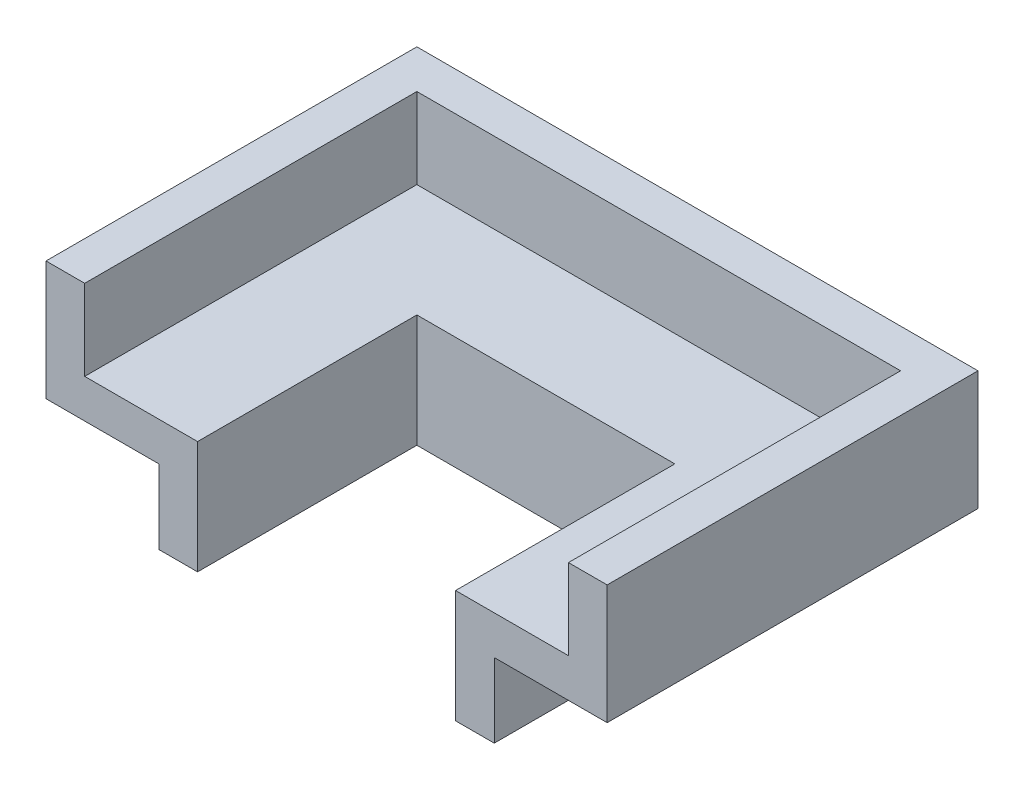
ISO-10303-21;
HEADER;
FILE_DESCRIPTION(('STEP AP214'),'2;1');
FILE_NAME('part.step','',(''),(''),'','','');
FILE_SCHEMA(('AUTOMOTIVE_DESIGN { 1 0 10303 214 1 1 1 1 }'));
ENDSEC;
DATA;
#1=APPLICATION_CONTEXT('core data for automotive mechanical design processes');
#2=APPLICATION_PROTOCOL_DEFINITION('international standard','automotive_design',2000,#1);
#3=PRODUCT_CONTEXT('',#1,'mechanical');
#4=PRODUCT('Part','Part','',(#3));
#5=PRODUCT_RELATED_PRODUCT_CATEGORY('part','',(#4));
#6=PRODUCT_DEFINITION_FORMATION('','',#4);
#7=PRODUCT_DEFINITION_CONTEXT('part definition',#1,'design');
#8=PRODUCT_DEFINITION('design','',#6,#7);
#9=PRODUCT_DEFINITION_SHAPE('','',#8);
#10=(LENGTH_UNIT() NAMED_UNIT(*) SI_UNIT(.MILLI.,.METRE.));
#11=(NAMED_UNIT(*) PLANE_ANGLE_UNIT() SI_UNIT($,.RADIAN.));
#12=(NAMED_UNIT(*) SI_UNIT($,.STERADIAN.) SOLID_ANGLE_UNIT());
#13=UNCERTAINTY_MEASURE_WITH_UNIT(LENGTH_MEASURE(1.E-05),#10,'distance_accuracy_value','');
#14=(GEOMETRIC_REPRESENTATION_CONTEXT(3) GLOBAL_UNCERTAINTY_ASSIGNED_CONTEXT((#13)) GLOBAL_UNIT_ASSIGNED_CONTEXT((#10,
#11,#12)) REPRESENTATION_CONTEXT('',''));
#15=CARTESIAN_POINT('',(0.,0.,0.));
#16=DIRECTION('',(0.,0.,1.));
#17=DIRECTION('',(1.,0.,0.));
#18=AXIS2_PLACEMENT_3D('',#15,#16,#17);
#19=CARTESIAN_POINT('',(-40.,0.,-68.));
#20=DIRECTION('',(1.,0.,0.));
#21=DIRECTION('',(0.,0.,-1.));
#22=AXIS2_PLACEMENT_3D('',#19,#20,#21);
#23=PLANE('',#22);
#24=DIRECTION('',(0.,0.,1.));
#25=VECTOR('',#24,1.);
#26=CARTESIAN_POINT('',(-40.,35.,-68.));
#27=LINE('',#26,#25);
#28=CARTESIAN_POINT('',(-40.,35.,-68.));
#29=VERTEX_POINT('',#28);
#30=CARTESIAN_POINT('',(-40.,35.,0.));
#31=VERTEX_POINT('',#30);
#32=EDGE_CURVE('E237',#29,#31,#27,.T.);
#33=ORIENTED_EDGE('',*,*,#32,.T.);
#34=DIRECTION('',(0.,-1.,0.));
#35=VECTOR('',#34,1.);
#36=CARTESIAN_POINT('',(-40.,0.,0.));
#37=LINE('',#36,#35);
#38=CARTESIAN_POINT('',(-39.9999999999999,0.,0.));
#39=VERTEX_POINT('',#38);
#40=EDGE_CURVE('E265',#31,#39,#37,.T.);
#41=ORIENTED_EDGE('',*,*,#40,.T.);
#42=DIRECTION('',(0.,0.,1.));
#43=VECTOR('',#42,1.);
#44=CARTESIAN_POINT('',(-40.,0.,-68.));
#45=LINE('',#44,#43);
#46=CARTESIAN_POINT('',(-40.,0.,-68.));
#47=VERTEX_POINT('',#46);
#48=EDGE_CURVE('E238',#47,#39,#45,.T.);
#49=ORIENTED_EDGE('',*,*,#48,.F.);
#50=DIRECTION('',(0.,1.,0.));
#51=VECTOR('',#50,1.);
#52=CARTESIAN_POINT('',(-40.,0.,-68.));
#53=LINE('',#52,#51);
#54=EDGE_CURVE('E240',#47,#29,#53,.T.);
#55=ORIENTED_EDGE('',*,*,#54,.T.);
#56=EDGE_LOOP('',(#33,#41,#49,#55));
#57=FACE_BOUND('',#56,.T.);
#58=ADVANCED_FACE('F41',(#57),#23,.T.);
#59=CARTESIAN_POINT('',(-52.,0.,-80.));
#60=DIRECTION('',(-1.,0.,0.));
#61=DIRECTION('',(0.,0.,1.));
#62=AXIS2_PLACEMENT_3D('',#59,#60,#61);
#63=PLANE('',#62);
#64=DIRECTION('',(0.,0.,1.));
#65=VECTOR('',#64,1.);
#66=CARTESIAN_POINT('',(-52.,0.,-80.));
#67=LINE('',#66,#65);
#68=CARTESIAN_POINT('',(-52.,0.,-80.));
#69=VERTEX_POINT('',#68);
#70=CARTESIAN_POINT('',(-52.,0.,0.));
#71=VERTEX_POINT('',#70);
#72=EDGE_CURVE('E245',#69,#71,#67,.T.);
#73=ORIENTED_EDGE('',*,*,#72,.T.);
#74=DIRECTION('',(0.,1.,0.));
#75=VECTOR('',#74,1.);
#76=CARTESIAN_POINT('',(-52.,0.,0.));
#77=LINE('',#76,#75);
#78=CARTESIAN_POINT('',(-52.,23.,0.));
#79=VERTEX_POINT('',#78);
#80=EDGE_CURVE('E299',#71,#79,#77,.T.);
#81=ORIENTED_EDGE('',*,*,#80,.T.);
#82=DIRECTION('',(0.,0.,1.));
#83=VECTOR('',#82,1.);
#84=CARTESIAN_POINT('',(-52.,23.,-80.));
#85=LINE('',#84,#83);
#86=CARTESIAN_POINT('',(-52.,23.,-80.));
#87=VERTEX_POINT('',#86);
#88=EDGE_CURVE('E249',#87,#79,#85,.T.);
#89=ORIENTED_EDGE('',*,*,#88,.F.);
#90=DIRECTION('',(0.,-1.,0.));
#91=VECTOR('',#90,1.);
#92=CARTESIAN_POINT('',(-52.,0.,-80.));
#93=LINE('',#92,#91);
#94=EDGE_CURVE('E271',#87,#69,#93,.T.);
#95=ORIENTED_EDGE('',*,*,#94,.T.);
#96=EDGE_LOOP('',(#73,#81,#89,#95));
#97=FACE_BOUND('',#96,.T.);
#98=ADVANCED_FACE('F309',(#97),#63,.T.);
#99=CARTESIAN_POINT('',(-87.,23.,-115.));
#100=DIRECTION('',(-1.,0.,0.));
#101=DIRECTION('',(0.,0.,1.));
#102=AXIS2_PLACEMENT_3D('',#99,#100,#101);
#103=PLANE('',#102);
#104=DIRECTION('',(0.,0.,1.));
#105=VECTOR('',#104,1.);
#106=CARTESIAN_POINT('',(-87.,23.,-115.));
#107=LINE('',#106,#105);
#108=CARTESIAN_POINT('',(-87.,23.,-115.));
#109=VERTEX_POINT('',#108);
#110=CARTESIAN_POINT('',(-87.,23.,0.));
#111=VERTEX_POINT('',#110);
#112=EDGE_CURVE('E248',#109,#111,#107,.T.);
#113=ORIENTED_EDGE('',*,*,#112,.T.);
#114=DIRECTION('',(0.,1.,0.));
#115=VECTOR('',#114,1.);
#116=CARTESIAN_POINT('',(-87.,23.,0.));
#117=LINE('',#116,#115);
#118=CARTESIAN_POINT('',(-87.0000000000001,60.,0.));
#119=VERTEX_POINT('',#118);
#120=EDGE_CURVE('E49',#111,#119,#117,.T.);
#121=ORIENTED_EDGE('',*,*,#120,.T.);
#122=DIRECTION('',(0.,0.,1.));
#123=VECTOR('',#122,1.);
#124=CARTESIAN_POINT('',(-87.0000000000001,60.,-115.));
#125=LINE('',#124,#123);
#126=CARTESIAN_POINT('',(-87.0000000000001,60.,-115.));
#127=VERTEX_POINT('',#126);
#128=EDGE_CURVE('E252',#127,#119,#125,.T.);
#129=ORIENTED_EDGE('',*,*,#128,.F.);
#130=DIRECTION('',(0.,-1.,0.));
#131=VECTOR('',#130,1.);
#132=CARTESIAN_POINT('',(-87.,23.,-115.));
#133=LINE('',#132,#131);
#134=EDGE_CURVE('E235',#127,#109,#133,.T.);
#135=ORIENTED_EDGE('',*,*,#134,.T.);
#136=EDGE_LOOP('',(#113,#121,#129,#135));
#137=FACE_BOUND('',#136,.T.);
#138=ADVANCED_FACE('F303',(#137),#103,.T.);
#139=CARTESIAN_POINT('',(-75.,35.,-103.));
#140=DIRECTION('',(1.,0.,0.));
#141=DIRECTION('',(0.,0.,-1.));
#142=AXIS2_PLACEMENT_3D('',#139,#140,#141);
#143=PLANE('',#142);
#144=DIRECTION('',(0.,0.,1.));
#145=VECTOR('',#144,1.);
#146=CARTESIAN_POINT('',(-75.,60.,-103.));
#147=LINE('',#146,#145);
#148=CARTESIAN_POINT('',(-75.,60.,-103.));
#149=VERTEX_POINT('',#148);
#150=CARTESIAN_POINT('',(-75.,60.,0.));
#151=VERTEX_POINT('',#150);
#152=EDGE_CURVE('E255',#149,#151,#147,.T.);
#153=ORIENTED_EDGE('',*,*,#152,.T.);
#154=DIRECTION('',(0.,-1.,0.));
#155=VECTOR('',#154,1.);
#156=CARTESIAN_POINT('',(-75.,35.,0.));
#157=LINE('',#156,#155);
#158=CARTESIAN_POINT('',(-75.,35.,0.));
#159=VERTEX_POINT('',#158);
#160=EDGE_CURVE('E44',#151,#159,#157,.T.);
#161=ORIENTED_EDGE('',*,*,#160,.T.);
#162=DIRECTION('',(0.,0.,1.));
#163=VECTOR('',#162,1.);
#164=CARTESIAN_POINT('',(-75.,35.,-103.));
#165=LINE('',#164,#163);
#166=CARTESIAN_POINT('',(-75.,35.,-103.));
#167=VERTEX_POINT('',#166);
#168=EDGE_CURVE('E258',#167,#159,#165,.T.);
#169=ORIENTED_EDGE('',*,*,#168,.F.);
#170=DIRECTION('',(0.,1.,0.));
#171=VECTOR('',#170,1.);
#172=CARTESIAN_POINT('',(-75.,35.,-103.));
#173=LINE('',#172,#171);
#174=EDGE_CURVE('E231',#167,#149,#173,.T.);
#175=ORIENTED_EDGE('',*,*,#174,.T.);
#176=EDGE_LOOP('',(#153,#161,#169,#175));
#177=FACE_BOUND('',#176,.T.);
#178=ADVANCED_FACE('F43',(#177),#143,.T.);
#179=CARTESIAN_POINT('',(40.,0.,-68.));
#180=DIRECTION('',(0.,0.,-1.));
#181=DIRECTION('',(-1.,0.,0.));
#182=AXIS2_PLACEMENT_3D('',#179,#180,#181);
#183=PLANE('',#182);
#184=ORIENTED_EDGE('',*,*,#54,.F.);
#185=DIRECTION('',(-1.,0.,0.));
#186=VECTOR('',#185,1.);
#187=CARTESIAN_POINT('',(40.,0.,-68.));
#188=LINE('',#187,#186);
#189=CARTESIAN_POINT('',(40.,0.,-68.));
#190=VERTEX_POINT('',#189);
#191=EDGE_CURVE('E213',#190,#47,#188,.T.);
#192=ORIENTED_EDGE('',*,*,#191,.F.);
#193=DIRECTION('',(0.,-1.,0.));
#194=VECTOR('',#193,1.);
#195=CARTESIAN_POINT('',(40.,0.,-68.));
#196=LINE('',#195,#194);
#197=CARTESIAN_POINT('',(40.,35.,-68.));
#198=VERTEX_POINT('',#197);
#199=EDGE_CURVE('E177',#198,#190,#196,.T.);
#200=ORIENTED_EDGE('',*,*,#199,.F.);
#201=DIRECTION('',(-1.,0.,0.));
#202=VECTOR('',#201,1.);
#203=CARTESIAN_POINT('',(40.,35.,-68.));
#204=LINE('',#203,#202);
#205=EDGE_CURVE('E209',#198,#29,#204,.T.);
#206=ORIENTED_EDGE('',*,*,#205,.T.);
#207=EDGE_LOOP('',(#184,#192,#200,#206));
#208=FACE_BOUND('',#207,.T.);
#209=ADVANCED_FACE('F295',(#208),#183,.F.);
#210=CARTESIAN_POINT('',(52.,0.,-80.));
#211=DIRECTION('',(0.,0.,1.));
#212=DIRECTION('',(1.,0.,0.));
#213=AXIS2_PLACEMENT_3D('',#210,#211,#212);
#214=PLANE('',#213);
#215=ORIENTED_EDGE('',*,*,#94,.F.);
#216=DIRECTION('',(-1.,0.,0.));
#217=VECTOR('',#216,1.);
#218=CARTESIAN_POINT('',(52.,23.,-80.));
#219=LINE('',#218,#217);
#220=CARTESIAN_POINT('',(52.,23.,-80.));
#221=VERTEX_POINT('',#220);
#222=EDGE_CURVE('E220',#221,#87,#219,.T.);
#223=ORIENTED_EDGE('',*,*,#222,.F.);
#224=DIRECTION('',(0.,1.,0.));
#225=VECTOR('',#224,1.);
#226=CARTESIAN_POINT('',(52.,0.,-80.));
#227=LINE('',#226,#225);
#228=CARTESIAN_POINT('',(52.,0.,-80.));
#229=VERTEX_POINT('',#228);
#230=EDGE_CURVE('E196',#229,#221,#227,.T.);
#231=ORIENTED_EDGE('',*,*,#230,.F.);
#232=DIRECTION('',(-1.,0.,0.));
#233=VECTOR('',#232,1.);
#234=CARTESIAN_POINT('',(52.,0.,-80.));
#235=LINE('',#234,#233);
#236=EDGE_CURVE('E157',#229,#69,#235,.T.);
#237=ORIENTED_EDGE('',*,*,#236,.T.);
#238=EDGE_LOOP('',(#215,#223,#231,#237));
#239=FACE_BOUND('',#238,.T.);
#240=ADVANCED_FACE('F315',(#239),#214,.F.);
#241=CARTESIAN_POINT('',(87.,23.,-115.));
#242=DIRECTION('',(0.,0.,1.));
#243=DIRECTION('',(1.,0.,0.));
#244=AXIS2_PLACEMENT_3D('',#241,#242,#243);
#245=PLANE('',#244);
#246=ORIENTED_EDGE('',*,*,#134,.F.);
#247=DIRECTION('',(-1.,0.,0.));
#248=VECTOR('',#247,1.);
#249=CARTESIAN_POINT('',(87.,60.,-115.));
#250=LINE('',#249,#248);
#251=CARTESIAN_POINT('',(87.,60.,-115.));
#252=VERTEX_POINT('',#251);
#253=EDGE_CURVE('E224',#252,#127,#250,.T.);
#254=ORIENTED_EDGE('',*,*,#253,.F.);
#255=DIRECTION('',(0.,1.,0.));
#256=VECTOR('',#255,1.);
#257=CARTESIAN_POINT('',(87.,23.,-115.));
#258=LINE('',#257,#256);
#259=CARTESIAN_POINT('',(87.,23.,-115.));
#260=VERTEX_POINT('',#259);
#261=EDGE_CURVE('E280',#260,#252,#258,.T.);
#262=ORIENTED_EDGE('',*,*,#261,.F.);
#263=DIRECTION('',(-1.,0.,0.));
#264=VECTOR('',#263,1.);
#265=CARTESIAN_POINT('',(87.,23.,-115.));
#266=LINE('',#265,#264);
#267=EDGE_CURVE('E219',#260,#109,#266,.T.);
#268=ORIENTED_EDGE('',*,*,#267,.T.);
#269=EDGE_LOOP('',(#246,#254,#262,#268));
#270=FACE_BOUND('',#269,.T.);
#271=ADVANCED_FACE('F332',(#270),#245,.F.);
#272=CARTESIAN_POINT('',(75.,35.,-103.));
#273=DIRECTION('',(0.,0.,-1.));
#274=DIRECTION('',(-1.,0.,0.));
#275=AXIS2_PLACEMENT_3D('',#272,#273,#274);
#276=PLANE('',#275);
#277=ORIENTED_EDGE('',*,*,#174,.F.);
#278=DIRECTION('',(-1.,0.,0.));
#279=VECTOR('',#278,1.);
#280=CARTESIAN_POINT('',(75.,35.,-103.));
#281=LINE('',#280,#279);
#282=CARTESIAN_POINT('',(75.,35.,-103.));
#283=VERTEX_POINT('',#282);
#284=EDGE_CURVE('E228',#283,#167,#281,.T.);
#285=ORIENTED_EDGE('',*,*,#284,.F.);
#286=DIRECTION('',(0.,-1.,0.));
#287=VECTOR('',#286,1.);
#288=CARTESIAN_POINT('',(75.,35.,-103.));
#289=LINE('',#288,#287);
#290=CARTESIAN_POINT('',(75.,60.,-103.));
#291=VERTEX_POINT('',#290);
#292=EDGE_CURVE('E276',#291,#283,#289,.T.);
#293=ORIENTED_EDGE('',*,*,#292,.F.);
#294=DIRECTION('',(-1.,0.,0.));
#295=VECTOR('',#294,1.);
#296=CARTESIAN_POINT('',(75.,60.,-103.));
#297=LINE('',#296,#295);
#298=EDGE_CURVE('E226',#291,#149,#297,.T.);
#299=ORIENTED_EDGE('',*,*,#298,.T.);
#300=EDGE_LOOP('',(#277,#285,#293,#299));
#301=FACE_BOUND('',#300,.T.);
#302=ADVANCED_FACE('F328',(#301),#276,.F.);
#303=CARTESIAN_POINT('',(0.,0.,0.));
#304=DIRECTION('',(0.,0.,1.));
#305=DIRECTION('',(1.,0.,0.));
#306=AXIS2_PLACEMENT_3D('',#303,#304,#305);
#307=PLANE('',#306);
#308=DIRECTION('',(1.,0.,0.));
#309=VECTOR('',#308,1.);
#310=CARTESIAN_POINT('',(40.,0.,0.));
#311=LINE('',#310,#309);
#312=CARTESIAN_POINT('',(40.,0.,0.));
#313=VERTEX_POINT('',#312);
#314=CARTESIAN_POINT('',(52.,0.,0.));
#315=VERTEX_POINT('',#314);
#316=EDGE_CURVE('E156',#313,#315,#311,.T.);
#317=ORIENTED_EDGE('',*,*,#316,.T.);
#318=DIRECTION('',(0.,1.,0.));
#319=VECTOR('',#318,1.);
#320=CARTESIAN_POINT('',(52.,0.,0.));
#321=LINE('',#320,#319);
#322=CARTESIAN_POINT('',(52.,23.,0.));
#323=VERTEX_POINT('',#322);
#324=EDGE_CURVE('E170',#315,#323,#321,.T.);
#325=ORIENTED_EDGE('',*,*,#324,.T.);
#326=DIRECTION('',(1.,0.,0.));
#327=VECTOR('',#326,1.);
#328=CARTESIAN_POINT('',(52.,23.,0.));
#329=LINE('',#328,#327);
#330=CARTESIAN_POINT('',(87.,23.,0.));
#331=VERTEX_POINT('',#330);
#332=EDGE_CURVE('E172',#323,#331,#329,.T.);
#333=ORIENTED_EDGE('',*,*,#332,.T.);
#334=DIRECTION('',(0.,1.,0.));
#335=VECTOR('',#334,1.);
#336=CARTESIAN_POINT('',(87.,23.,0.));
#337=LINE('',#336,#335);
#338=CARTESIAN_POINT('',(87.,60.,0.));
#339=VERTEX_POINT('',#338);
#340=EDGE_CURVE('E184',#331,#339,#337,.T.);
#341=ORIENTED_EDGE('',*,*,#340,.T.);
#342=DIRECTION('',(-1.,0.,0.));
#343=VECTOR('',#342,1.);
#344=CARTESIAN_POINT('',(75.,60.,0.));
#345=LINE('',#344,#343);
#346=CARTESIAN_POINT('',(75.,60.,0.));
#347=VERTEX_POINT('',#346);
#348=EDGE_CURVE('E186',#339,#347,#345,.T.);
#349=ORIENTED_EDGE('',*,*,#348,.T.);
#350=DIRECTION('',(0.,-1.,0.));
#351=VECTOR('',#350,1.);
#352=CARTESIAN_POINT('',(75.,35.,0.));
#353=LINE('',#352,#351);
#354=CARTESIAN_POINT('',(75.,35.,0.));
#355=VERTEX_POINT('',#354);
#356=EDGE_CURVE('E187',#347,#355,#353,.T.);
#357=ORIENTED_EDGE('',*,*,#356,.T.);
#358=DIRECTION('',(-1.,0.,0.));
#359=VECTOR('',#358,1.);
#360=CARTESIAN_POINT('',(40.,35.,0.));
#361=LINE('',#360,#359);
#362=CARTESIAN_POINT('',(40.,35.,0.));
#363=VERTEX_POINT('',#362);
#364=EDGE_CURVE('E195',#355,#363,#361,.T.);
#365=ORIENTED_EDGE('',*,*,#364,.T.);
#366=DIRECTION('',(0.,-1.,0.));
#367=VECTOR('',#366,1.);
#368=CARTESIAN_POINT('',(40.,0.,0.));
#369=LINE('',#368,#367);
#370=EDGE_CURVE('E163',#363,#313,#369,.T.);
#371=ORIENTED_EDGE('',*,*,#370,.T.);
#372=EDGE_LOOP('',(#317,#325,#333,#341,#349,#357,#365,#371));
#373=FACE_BOUND('',#372,.T.);
#374=ADVANCED_FACE('F174',(#373),#307,.T.);
#375=CARTESIAN_POINT('',(40.,0.,-167.716796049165));
#376=DIRECTION('',(0.,-1.,0.));
#377=DIRECTION('',(0.,0.,-1.));
#378=AXIS2_PLACEMENT_3D('',#375,#376,#377);
#379=PLANE('',#378);
#380=DIRECTION('',(0.,0.,1.));
#381=VECTOR('',#380,1.);
#382=CARTESIAN_POINT('',(40.,0.,-167.716796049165));
#383=LINE('',#382,#381);
#384=EDGE_CURVE('E198',#190,#313,#383,.T.);
#385=ORIENTED_EDGE('',*,*,#384,.F.);
#386=ORIENTED_EDGE('',*,*,#191,.T.);
#387=ORIENTED_EDGE('',*,*,#48,.T.);
#388=DIRECTION('',(-1.,0.,0.));
#389=VECTOR('',#388,1.);
#390=CARTESIAN_POINT('',(0.,0.,0.));
#391=LINE('',#390,#389);
#392=EDGE_CURVE('E264',#39,#71,#391,.T.);
#393=ORIENTED_EDGE('',*,*,#392,.T.);
#394=ORIENTED_EDGE('',*,*,#72,.F.);
#395=ORIENTED_EDGE('',*,*,#236,.F.);
#396=DIRECTION('',(0.,0.,1.));
#397=VECTOR('',#396,1.);
#398=CARTESIAN_POINT('',(52.,0.,-167.716796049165));
#399=LINE('',#398,#397);
#400=EDGE_CURVE('E151',#229,#315,#399,.T.);
#401=ORIENTED_EDGE('',*,*,#400,.T.);
#402=ORIENTED_EDGE('',*,*,#316,.F.);
#403=EDGE_LOOP('',(#385,#386,#387,#393,#394,#395,#401,#402));
#404=FACE_BOUND('',#403,.T.);
#405=ADVANCED_FACE('F152',(#404),#379,.T.);
#406=CARTESIAN_POINT('',(52.,0.,-167.716796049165));
#407=DIRECTION('',(1.,0.,0.));
#408=DIRECTION('',(0.,0.,-1.));
#409=AXIS2_PLACEMENT_3D('',#406,#407,#408);
#410=PLANE('',#409);
#411=ORIENTED_EDGE('',*,*,#400,.F.);
#412=ORIENTED_EDGE('',*,*,#230,.T.);
#413=DIRECTION('',(0.,0.,1.));
#414=VECTOR('',#413,1.);
#415=CARTESIAN_POINT('',(52.,23.,-167.716796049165));
#416=LINE('',#415,#414);
#417=EDGE_CURVE('E162',#221,#323,#416,.T.);
#418=ORIENTED_EDGE('',*,*,#417,.T.);
#419=ORIENTED_EDGE('',*,*,#324,.F.);
#420=EDGE_LOOP('',(#411,#412,#418,#419));
#421=FACE_BOUND('',#420,.T.);
#422=ADVANCED_FACE('F169',(#421),#410,.T.);
#423=CARTESIAN_POINT('',(52.,23.,-167.716796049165));
#424=DIRECTION('',(0.,-1.,0.));
#425=DIRECTION('',(0.,0.,-1.));
#426=AXIS2_PLACEMENT_3D('',#423,#424,#425);
#427=PLANE('',#426);
#428=ORIENTED_EDGE('',*,*,#417,.F.);
#429=ORIENTED_EDGE('',*,*,#222,.T.);
#430=ORIENTED_EDGE('',*,*,#88,.T.);
#431=DIRECTION('',(-1.,0.,0.));
#432=VECTOR('',#431,1.);
#433=CARTESIAN_POINT('',(0.,23.,0.));
#434=LINE('',#433,#432);
#435=EDGE_CURVE('E296',#79,#111,#434,.T.);
#436=ORIENTED_EDGE('',*,*,#435,.T.);
#437=ORIENTED_EDGE('',*,*,#112,.F.);
#438=ORIENTED_EDGE('',*,*,#267,.F.);
#439=DIRECTION('',(0.,0.,1.));
#440=VECTOR('',#439,1.);
#441=CARTESIAN_POINT('',(87.,23.,-167.716796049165));
#442=LINE('',#441,#440);
#443=EDGE_CURVE('E210',#260,#331,#442,.T.);
#444=ORIENTED_EDGE('',*,*,#443,.T.);
#445=ORIENTED_EDGE('',*,*,#332,.F.);
#446=EDGE_LOOP('',(#428,#429,#430,#436,#437,#438,#444,#445));
#447=FACE_BOUND('',#446,.T.);
#448=ADVANCED_FACE('F307',(#447),#427,.T.);
#449=CARTESIAN_POINT('',(87.,23.,-167.716796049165));
#450=DIRECTION('',(1.,0.,0.));
#451=DIRECTION('',(0.,0.,-1.));
#452=AXIS2_PLACEMENT_3D('',#449,#450,#451);
#453=PLANE('',#452);
#454=ORIENTED_EDGE('',*,*,#443,.F.);
#455=ORIENTED_EDGE('',*,*,#261,.T.);
#456=DIRECTION('',(0.,0.,1.));
#457=VECTOR('',#456,1.);
#458=CARTESIAN_POINT('',(87.,60.,-167.716796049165));
#459=LINE('',#458,#457);
#460=EDGE_CURVE('E202',#252,#339,#459,.T.);
#461=ORIENTED_EDGE('',*,*,#460,.T.);
#462=ORIENTED_EDGE('',*,*,#340,.F.);
#463=EDGE_LOOP('',(#454,#455,#461,#462));
#464=FACE_BOUND('',#463,.T.);
#465=ADVANCED_FACE('F320',(#464),#453,.T.);
#466=CARTESIAN_POINT('',(75.,60.,-167.716796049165));
#467=DIRECTION('',(0.,1.,0.));
#468=DIRECTION('',(0.,0.,1.));
#469=AXIS2_PLACEMENT_3D('',#466,#467,#468);
#470=PLANE('',#469);
#471=ORIENTED_EDGE('',*,*,#460,.F.);
#472=ORIENTED_EDGE('',*,*,#253,.T.);
#473=ORIENTED_EDGE('',*,*,#128,.T.);
#474=DIRECTION('',(1.,0.,0.));
#475=VECTOR('',#474,1.);
#476=CARTESIAN_POINT('',(0.,60.,0.));
#477=LINE('',#476,#475);
#478=EDGE_CURVE('E12',#119,#151,#477,.T.);
#479=ORIENTED_EDGE('',*,*,#478,.T.);
#480=ORIENTED_EDGE('',*,*,#152,.F.);
#481=ORIENTED_EDGE('',*,*,#298,.F.);
#482=DIRECTION('',(0.,0.,1.));
#483=VECTOR('',#482,1.);
#484=CARTESIAN_POINT('',(75.,60.,-167.716796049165));
#485=LINE('',#484,#483);
#486=EDGE_CURVE('E201',#291,#347,#485,.T.);
#487=ORIENTED_EDGE('',*,*,#486,.T.);
#488=ORIENTED_EDGE('',*,*,#348,.F.);
#489=EDGE_LOOP('',(#471,#472,#473,#479,#480,#481,#487,#488));
#490=FACE_BOUND('',#489,.T.);
#491=ADVANCED_FACE('F321',(#490),#470,.T.);
#492=CARTESIAN_POINT('',(75.,35.,-167.716796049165));
#493=DIRECTION('',(-1.,0.,0.));
#494=DIRECTION('',(0.,0.,1.));
#495=AXIS2_PLACEMENT_3D('',#492,#493,#494);
#496=PLANE('',#495);
#497=ORIENTED_EDGE('',*,*,#486,.F.);
#498=ORIENTED_EDGE('',*,*,#292,.T.);
#499=DIRECTION('',(0.,0.,1.));
#500=VECTOR('',#499,1.);
#501=CARTESIAN_POINT('',(75.,35.,-167.716796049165));
#502=LINE('',#501,#500);
#503=EDGE_CURVE('E203',#283,#355,#502,.T.);
#504=ORIENTED_EDGE('',*,*,#503,.T.);
#505=ORIENTED_EDGE('',*,*,#356,.F.);
#506=EDGE_LOOP('',(#497,#498,#504,#505));
#507=FACE_BOUND('',#506,.T.);
#508=ADVANCED_FACE('F323',(#507),#496,.T.);
#509=CARTESIAN_POINT('',(40.,35.,-167.716796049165));
#510=DIRECTION('',(0.,1.,0.));
#511=DIRECTION('',(0.,0.,1.));
#512=AXIS2_PLACEMENT_3D('',#509,#510,#511);
#513=PLANE('',#512);
#514=ORIENTED_EDGE('',*,*,#503,.F.);
#515=ORIENTED_EDGE('',*,*,#284,.T.);
#516=ORIENTED_EDGE('',*,*,#168,.T.);
#517=DIRECTION('',(1.,0.,0.));
#518=VECTOR('',#517,1.);
#519=CARTESIAN_POINT('',(0.,35.,0.));
#520=LINE('',#519,#518);
#521=EDGE_CURVE('E257',#159,#31,#520,.T.);
#522=ORIENTED_EDGE('',*,*,#521,.T.);
#523=ORIENTED_EDGE('',*,*,#32,.F.);
#524=ORIENTED_EDGE('',*,*,#205,.F.);
#525=DIRECTION('',(0.,0.,1.));
#526=VECTOR('',#525,1.);
#527=CARTESIAN_POINT('',(40.,35.,-167.716796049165));
#528=LINE('',#527,#526);
#529=EDGE_CURVE('E200',#198,#363,#528,.T.);
#530=ORIENTED_EDGE('',*,*,#529,.T.);
#531=ORIENTED_EDGE('',*,*,#364,.F.);
#532=EDGE_LOOP('',(#514,#515,#516,#522,#523,#524,#530,#531));
#533=FACE_BOUND('',#532,.T.);
#534=ADVANCED_FACE('F326',(#533),#513,.T.);
#535=CARTESIAN_POINT('',(40.,0.,-167.716796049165));
#536=DIRECTION('',(-1.,0.,0.));
#537=DIRECTION('',(0.,0.,1.));
#538=AXIS2_PLACEMENT_3D('',#535,#536,#537);
#539=PLANE('',#538);
#540=ORIENTED_EDGE('',*,*,#529,.F.);
#541=ORIENTED_EDGE('',*,*,#199,.T.);
#542=ORIENTED_EDGE('',*,*,#384,.T.);
#543=ORIENTED_EDGE('',*,*,#370,.F.);
#544=EDGE_LOOP('',(#540,#541,#542,#543));
#545=FACE_BOUND('',#544,.T.);
#546=ADVANCED_FACE('F286',(#545),#539,.T.);
#547=CARTESIAN_POINT('',(-63.5,30.,0.));
#548=DIRECTION('',(0.,0.,1.));
#549=DIRECTION('',(1.,0.,0.));
#550=AXIS2_PLACEMENT_3D('',#547,#548,#549);
#551=PLANE('',#550);
#552=ORIENTED_EDGE('',*,*,#160,.F.);
#553=ORIENTED_EDGE('',*,*,#478,.F.);
#554=ORIENTED_EDGE('',*,*,#120,.F.);
#555=ORIENTED_EDGE('',*,*,#435,.F.);
#556=ORIENTED_EDGE('',*,*,#80,.F.);
#557=ORIENTED_EDGE('',*,*,#392,.F.);
#558=ORIENTED_EDGE('',*,*,#40,.F.);
#559=ORIENTED_EDGE('',*,*,#521,.F.);
#560=EDGE_LOOP('',(#552,#553,#554,#555,#556,#557,#558,#559));
#561=FACE_BOUND('',#560,.T.);
#562=ADVANCED_FACE('F294',(#561),#551,.T.);
#563=CLOSED_SHELL('',(#58,#98,#138,#178,#209,#240,#271,#302,#374,#405,#422,#448,#465,#491,#508,
#534,#546,#562));
#564=MANIFOLD_SOLID_BREP('B2',#563);
#565=ADVANCED_BREP_SHAPE_REPRESENTATION('',(#18,#564),#14);
#566=SHAPE_DEFINITION_REPRESENTATION(#9,#565);
ENDSEC;
END-ISO-10303-21;
